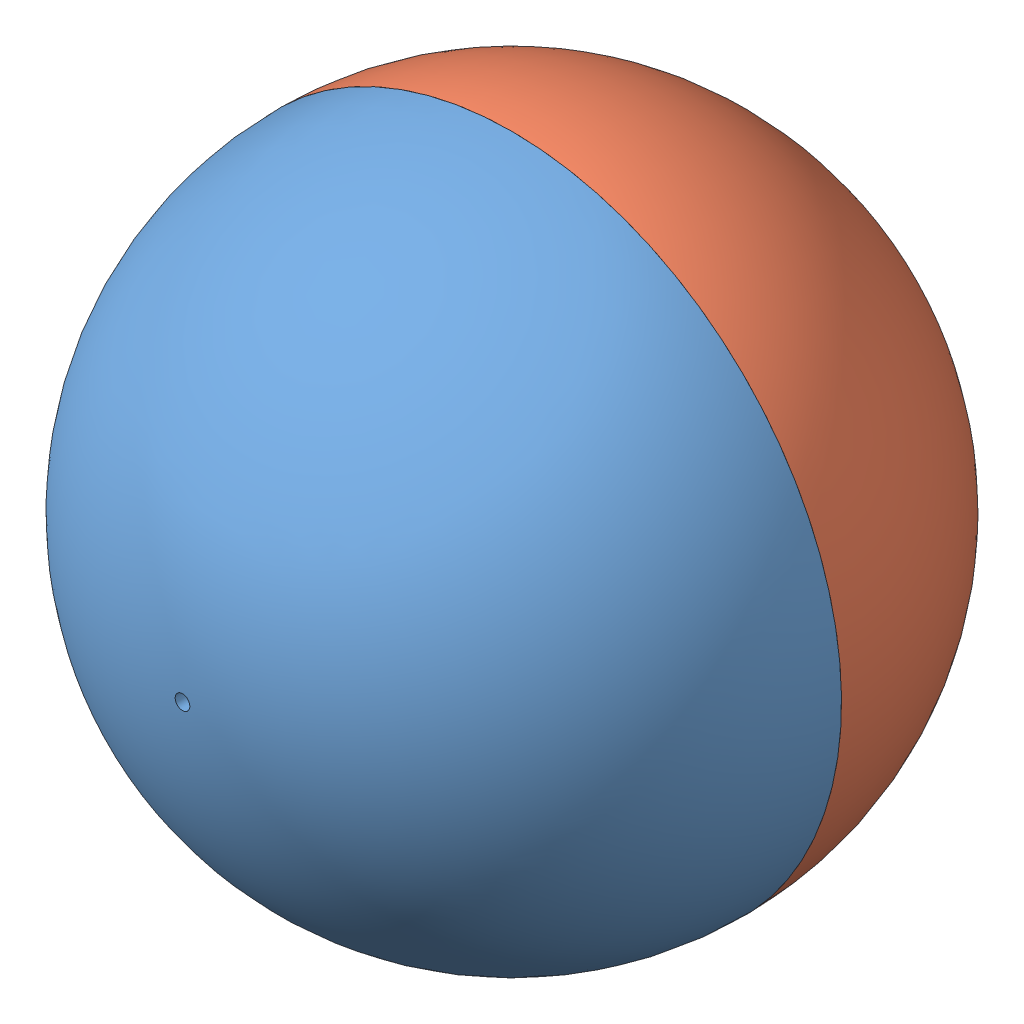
SolidWorks assembly Sphere_MainParts.SLDASM, configuration Default (file format 13000). Lengths in mm.
Overall size (418.71 418.71 299.93).
3 component instances, 3 part files, 3 mates.
Components (placement in the parent):
- top-2: top.SLDPRT [Default] at (-16.5678 -233.3689 136.3262) x (0.811852 0.583864 0) z (0 0 -1) size (300 300 157.96)
- Bottom-4: Bottom.SLDPRT [Default] at (-16.5678 -233.3689 136.3262) x (1 0 0) z (0 0 -1) size (300 300 149.96)
- O_ring-1: O_ring.SLDPRT [Default] at (-16.5678 -233.3689 135.6262) size (297 297 3)
Mates (geometry in assembly coordinates):
- Coincident2: coincident aligned: circle of top-2; circle of Bottom-4
- Tangent7: tangent anti-aligned: torus of O_ring-1; plane of Bottom-4 through (-16.5678 -378.8689 134.1262) normal (0 0 1)
- Tangent8: tangent aligned: cylinder of Bottom-4 through (-16.5678 -233.3689 135.2262) axis (0 0 -1) radius 148.5; torus of O_ring-1
